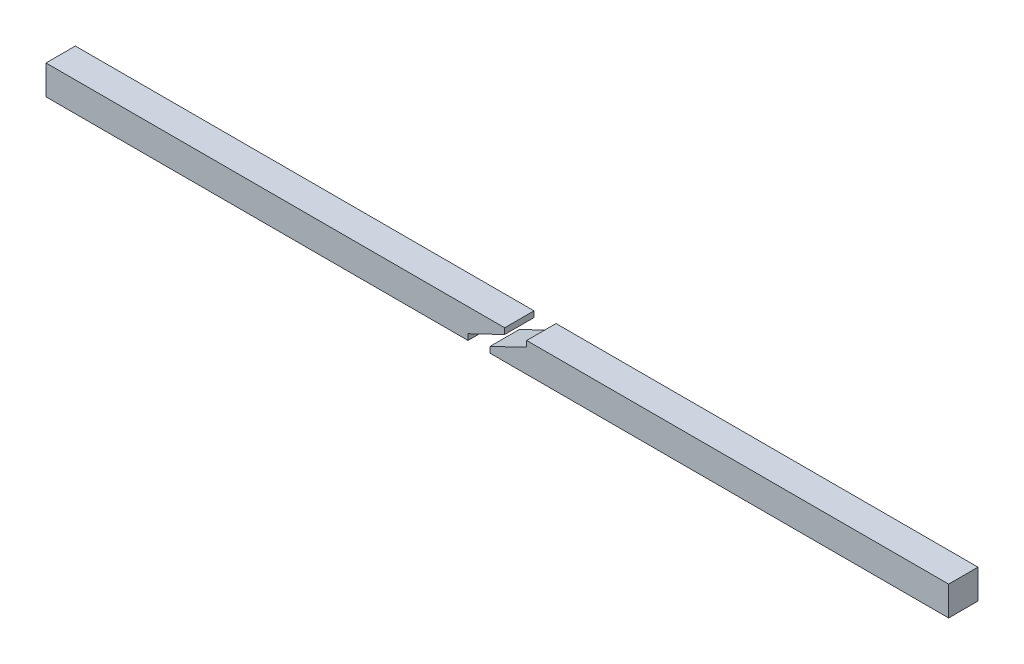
ISO-10303-21;
HEADER;
FILE_DESCRIPTION(('STEP AP214'),'2;1');
FILE_NAME('part.step','',(''),(''),'','','');
FILE_SCHEMA(('AUTOMOTIVE_DESIGN { 1 0 10303 214 1 1 1 1 }'));
ENDSEC;
DATA;
#1=APPLICATION_CONTEXT('core data for automotive mechanical design processes');
#2=APPLICATION_PROTOCOL_DEFINITION('international standard','automotive_design',2000,#1);
#3=PRODUCT_CONTEXT('',#1,'mechanical');
#4=PRODUCT('Part','Part','',(#3));
#5=PRODUCT_RELATED_PRODUCT_CATEGORY('part','',(#4));
#6=PRODUCT_DEFINITION_FORMATION('','',#4);
#7=PRODUCT_DEFINITION_CONTEXT('part definition',#1,'design');
#8=PRODUCT_DEFINITION('design','',#6,#7);
#9=PRODUCT_DEFINITION_SHAPE('','',#8);
#10=(LENGTH_UNIT() NAMED_UNIT(*) SI_UNIT(.MILLI.,.METRE.));
#11=(NAMED_UNIT(*) PLANE_ANGLE_UNIT() SI_UNIT($,.RADIAN.));
#12=(NAMED_UNIT(*) SI_UNIT($,.STERADIAN.) SOLID_ANGLE_UNIT());
#13=UNCERTAINTY_MEASURE_WITH_UNIT(LENGTH_MEASURE(1.E-05),#10,'distance_accuracy_value','');
#14=(GEOMETRIC_REPRESENTATION_CONTEXT(3) GLOBAL_UNCERTAINTY_ASSIGNED_CONTEXT((#13)) GLOBAL_UNIT_ASSIGNED_CONTEXT((#10,
#11,#12)) REPRESENTATION_CONTEXT('',''));
#15=CARTESIAN_POINT('',(0.,0.,0.));
#16=DIRECTION('',(0.,0.,1.));
#17=DIRECTION('',(1.,0.,0.));
#18=AXIS2_PLACEMENT_3D('',#15,#16,#17);
#19=CARTESIAN_POINT('',(6000.,-100.,-100.));
#20=DIRECTION('',(0.,1.,0.));
#21=DIRECTION('',(0.,0.,1.));
#22=AXIS2_PLACEMENT_3D('',#19,#20,#21);
#23=PLANE('',#22);
#24=DIRECTION('',(0.,0.,-1.));
#25=VECTOR('',#24,1.);
#26=CARTESIAN_POINT('',(2875.,-100.,-100.));
#27=LINE('',#26,#25);
#28=CARTESIAN_POINT('',(2875.,-100.,100.));
#29=VERTEX_POINT('',#28);
#30=CARTESIAN_POINT('',(2875.,-100.,-100.));
#31=VERTEX_POINT('',#30);
#32=EDGE_CURVE('E158',#29,#31,#27,.T.);
#33=ORIENTED_EDGE('',*,*,#32,.T.);
#34=DIRECTION('',(-1.,0.,0.));
#35=VECTOR('',#34,1.);
#36=CARTESIAN_POINT('',(6000.,-100.,-100.));
#37=LINE('',#36,#35);
#38=CARTESIAN_POINT('',(6000.,-100.,-100.));
#39=VERTEX_POINT('',#38);
#40=EDGE_CURVE('E13',#39,#31,#37,.T.);
#41=ORIENTED_EDGE('',*,*,#40,.F.);
#42=DIRECTION('',(0.,0.,-1.));
#43=VECTOR('',#42,1.);
#44=CARTESIAN_POINT('',(6000.,-100.,-100.));
#45=LINE('',#44,#43);
#46=CARTESIAN_POINT('',(6000.,-100.,100.));
#47=VERTEX_POINT('',#46);
#48=EDGE_CURVE('E160',#47,#39,#45,.T.);
#49=ORIENTED_EDGE('',*,*,#48,.F.);
#50=DIRECTION('',(-1.,0.,0.));
#51=VECTOR('',#50,1.);
#52=CARTESIAN_POINT('',(6000.,-100.,100.));
#53=LINE('',#52,#51);
#54=EDGE_CURVE('E166',#47,#29,#53,.T.);
#55=ORIENTED_EDGE('',*,*,#54,.T.);
#56=EDGE_LOOP('',(#33,#41,#49,#55));
#57=FACE_BOUND('',#56,.T.);
#58=ADVANCED_FACE('F75',(#57),#23,.F.);
#59=CARTESIAN_POINT('',(6000.,100.,-100.));
#60=DIRECTION('',(0.,0.,1.));
#61=DIRECTION('',(0.,-1.,0.));
#62=AXIS2_PLACEMENT_3D('',#59,#60,#61);
#63=PLANE('',#62);
#64=DIRECTION('',(0.,1.,0.));
#65=VECTOR('',#64,1.);
#66=CARTESIAN_POINT('',(2875.,100.,-100.));
#67=LINE('',#66,#65);
#68=CARTESIAN_POINT('',(2875.,-60.,-100.));
#69=VERTEX_POINT('',#68);
#70=EDGE_CURVE('E150',#31,#69,#67,.T.);
#71=ORIENTED_EDGE('',*,*,#70,.T.);
#72=DIRECTION('',(0.901523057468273,0.432731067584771,0.));
#73=VECTOR('',#72,1.);
#74=CARTESIAN_POINT('',(3125.,60.,-100.));
#75=LINE('',#74,#73);
#76=CARTESIAN_POINT('',(3125.,60.,-100.));
#77=VERTEX_POINT('',#76);
#78=EDGE_CURVE('E89',#69,#77,#75,.T.);
#79=ORIENTED_EDGE('',*,*,#78,.T.);
#80=DIRECTION('',(0.,1.,0.));
#81=VECTOR('',#80,1.);
#82=CARTESIAN_POINT('',(3125.,100.,-100.));
#83=LINE('',#82,#81);
#84=CARTESIAN_POINT('',(3125.,100.,-100.));
#85=VERTEX_POINT('',#84);
#86=EDGE_CURVE('E141',#77,#85,#83,.T.);
#87=ORIENTED_EDGE('',*,*,#86,.T.);
#88=DIRECTION('',(-1.,0.,0.));
#89=VECTOR('',#88,1.);
#90=CARTESIAN_POINT('',(6000.,100.,-100.));
#91=LINE('',#90,#89);
#92=CARTESIAN_POINT('',(6000.,100.,-100.));
#93=VERTEX_POINT('',#92);
#94=EDGE_CURVE('E82',#93,#85,#91,.T.);
#95=ORIENTED_EDGE('',*,*,#94,.F.);
#96=DIRECTION('',(0.,1.,0.));
#97=VECTOR('',#96,1.);
#98=CARTESIAN_POINT('',(6000.,100.,-100.));
#99=LINE('',#98,#97);
#100=EDGE_CURVE('E120',#39,#93,#99,.T.);
#101=ORIENTED_EDGE('',*,*,#100,.F.);
#102=ORIENTED_EDGE('',*,*,#40,.T.);
#103=EDGE_LOOP('',(#71,#79,#87,#95,#101,#102));
#104=FACE_BOUND('',#103,.T.);
#105=ADVANCED_FACE('F149',(#104),#63,.F.);
#106=CARTESIAN_POINT('',(6000.,100.,-100.));
#107=DIRECTION('',(0.,-1.,0.));
#108=DIRECTION('',(0.,0.,-1.));
#109=AXIS2_PLACEMENT_3D('',#106,#107,#108);
#110=PLANE('',#109);
#111=ORIENTED_EDGE('',*,*,#94,.T.);
#112=DIRECTION('',(0.,0.,1.));
#113=VECTOR('',#112,1.);
#114=CARTESIAN_POINT('',(3125.,100.,-100.));
#115=LINE('',#114,#113);
#116=CARTESIAN_POINT('',(3125.,100.,100.));
#117=VERTEX_POINT('',#116);
#118=EDGE_CURVE('E140',#85,#117,#115,.T.);
#119=ORIENTED_EDGE('',*,*,#118,.T.);
#120=DIRECTION('',(-1.,0.,0.));
#121=VECTOR('',#120,1.);
#122=CARTESIAN_POINT('',(6000.,100.,100.));
#123=LINE('',#122,#121);
#124=CARTESIAN_POINT('',(6000.,100.,100.));
#125=VERTEX_POINT('',#124);
#126=EDGE_CURVE('E172',#125,#117,#123,.T.);
#127=ORIENTED_EDGE('',*,*,#126,.F.);
#128=DIRECTION('',(0.,0.,1.));
#129=VECTOR('',#128,1.);
#130=CARTESIAN_POINT('',(6000.,100.,-100.));
#131=LINE('',#130,#129);
#132=EDGE_CURVE('E163',#93,#125,#131,.T.);
#133=ORIENTED_EDGE('',*,*,#132,.F.);
#134=EDGE_LOOP('',(#111,#119,#127,#133));
#135=FACE_BOUND('',#134,.T.);
#136=ADVANCED_FACE('F176',(#135),#110,.F.);
#137=CARTESIAN_POINT('',(6000.,100.,100.));
#138=DIRECTION('',(0.,0.,-1.));
#139=DIRECTION('',(0.,1.,0.));
#140=AXIS2_PLACEMENT_3D('',#137,#138,#139);
#141=PLANE('',#140);
#142=DIRECTION('',(0.,1.,0.));
#143=VECTOR('',#142,1.);
#144=CARTESIAN_POINT('',(3125.,100.,100.));
#145=LINE('',#144,#143);
#146=CARTESIAN_POINT('',(3125.,60.,100.));
#147=VERTEX_POINT('',#146);
#148=EDGE_CURVE('E151',#147,#117,#145,.T.);
#149=ORIENTED_EDGE('',*,*,#148,.F.);
#150=DIRECTION('',(0.901523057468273,0.432731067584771,0.));
#151=VECTOR('',#150,1.);
#152=CARTESIAN_POINT('',(3125.,60.,100.));
#153=LINE('',#152,#151);
#154=CARTESIAN_POINT('',(2875.,-60.,100.));
#155=VERTEX_POINT('',#154);
#156=EDGE_CURVE('E137',#155,#147,#153,.T.);
#157=ORIENTED_EDGE('',*,*,#156,.F.);
#158=DIRECTION('',(0.,-1.,0.));
#159=VECTOR('',#158,1.);
#160=CARTESIAN_POINT('',(2875.,100.,100.));
#161=LINE('',#160,#159);
#162=EDGE_CURVE('E113',#155,#29,#161,.T.);
#163=ORIENTED_EDGE('',*,*,#162,.T.);
#164=ORIENTED_EDGE('',*,*,#54,.F.);
#165=DIRECTION('',(0.,-1.,0.));
#166=VECTOR('',#165,1.);
#167=CARTESIAN_POINT('',(6000.,100.,100.));
#168=LINE('',#167,#166);
#169=EDGE_CURVE('E98',#125,#47,#168,.T.);
#170=ORIENTED_EDGE('',*,*,#169,.F.);
#171=ORIENTED_EDGE('',*,*,#126,.T.);
#172=EDGE_LOOP('',(#149,#157,#163,#164,#170,#171));
#173=FACE_BOUND('',#172,.T.);
#174=ADVANCED_FACE('F185',(#173),#141,.F.);
#175=CARTESIAN_POINT('',(6000.,0.,0.));
#176=DIRECTION('',(1.,0.,0.));
#177=DIRECTION('',(0.,0.,-1.));
#178=AXIS2_PLACEMENT_3D('',#175,#176,#177);
#179=PLANE('',#178);
#180=ORIENTED_EDGE('',*,*,#48,.T.);
#181=ORIENTED_EDGE('',*,*,#100,.T.);
#182=ORIENTED_EDGE('',*,*,#132,.T.);
#183=ORIENTED_EDGE('',*,*,#169,.T.);
#184=EDGE_LOOP('',(#180,#181,#182,#183));
#185=FACE_BOUND('',#184,.T.);
#186=ADVANCED_FACE('F178',(#185),#179,.T.);
#187=CARTESIAN_POINT('',(2875.,0.,0.));
#188=DIRECTION('',(1.,0.,0.));
#189=DIRECTION('',(0.,0.,-1.));
#190=AXIS2_PLACEMENT_3D('',#187,#188,#189);
#191=PLANE('',#190);
#192=ORIENTED_EDGE('',*,*,#162,.F.);
#193=DIRECTION('',(0.,0.,1.));
#194=VECTOR('',#193,1.);
#195=CARTESIAN_POINT('',(2875.,-60.,-100.));
#196=LINE('',#195,#194);
#197=EDGE_CURVE('E156',#69,#155,#196,.T.);
#198=ORIENTED_EDGE('',*,*,#197,.F.);
#199=ORIENTED_EDGE('',*,*,#70,.F.);
#200=ORIENTED_EDGE('',*,*,#32,.F.);
#201=EDGE_LOOP('',(#192,#198,#199,#200));
#202=FACE_BOUND('',#201,.T.);
#203=ADVANCED_FACE('F184',(#202),#191,.F.);
#204=CARTESIAN_POINT('',(3125.,60.,-100.));
#205=DIRECTION('',(0.432731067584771,-0.901523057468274,0.));
#206=DIRECTION('',(0.901523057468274,0.432731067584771,0.));
#207=AXIS2_PLACEMENT_3D('',#204,#205,#206);
#208=PLANE('',#207);
#209=ORIENTED_EDGE('',*,*,#156,.T.);
#210=DIRECTION('',(0.,0.,1.));
#211=VECTOR('',#210,1.);
#212=CARTESIAN_POINT('',(3125.,60.,-100.));
#213=LINE('',#212,#211);
#214=EDGE_CURVE('E134',#77,#147,#213,.T.);
#215=ORIENTED_EDGE('',*,*,#214,.F.);
#216=ORIENTED_EDGE('',*,*,#78,.F.);
#217=ORIENTED_EDGE('',*,*,#197,.T.);
#218=EDGE_LOOP('',(#209,#215,#216,#217));
#219=FACE_BOUND('',#218,.T.);
#220=ADVANCED_FACE('F136',(#219),#208,.F.);
#221=CARTESIAN_POINT('',(3125.,100.,-100.));
#222=DIRECTION('',(1.,0.,0.));
#223=DIRECTION('',(0.,0.,-1.));
#224=AXIS2_PLACEMENT_3D('',#221,#222,#223);
#225=PLANE('',#224);
#226=ORIENTED_EDGE('',*,*,#148,.T.);
#227=ORIENTED_EDGE('',*,*,#118,.F.);
#228=ORIENTED_EDGE('',*,*,#86,.F.);
#229=ORIENTED_EDGE('',*,*,#214,.T.);
#230=EDGE_LOOP('',(#226,#227,#228,#229));
#231=FACE_BOUND('',#230,.T.);
#232=ADVANCED_FACE('F144',(#231),#225,.F.);
#233=CLOSED_SHELL('',(#58,#105,#136,#174,#186,#203,#220,#232));
#234=MANIFOLD_SOLID_BREP('B2',#233);
#235=CARTESIAN_POINT('',(2975.,-100.,-100.));
#236=DIRECTION('',(0.,1.,0.));
#237=DIRECTION('',(0.,0.,1.));
#238=AXIS2_PLACEMENT_3D('',#235,#236,#237);
#239=PLANE('',#238);
#240=DIRECTION('',(-1.,0.,0.));
#241=VECTOR('',#240,1.);
#242=CARTESIAN_POINT('',(2975.,-100.,-100.));
#243=LINE('',#242,#241);
#244=CARTESIAN_POINT('',(2725.,-100.,-100.));
#245=VERTEX_POINT('',#244);
#246=CARTESIAN_POINT('',(-150.,-100.,-100.));
#247=VERTEX_POINT('',#246);
#248=EDGE_CURVE('E73',#245,#247,#243,.T.);
#249=ORIENTED_EDGE('',*,*,#248,.F.);
#250=DIRECTION('',(0.,0.,1.));
#251=VECTOR('',#250,1.);
#252=CARTESIAN_POINT('',(2725.,-100.,-100.));
#253=LINE('',#252,#251);
#254=CARTESIAN_POINT('',(2725.,-100.,100.));
#255=VERTEX_POINT('',#254);
#256=EDGE_CURVE('E328',#245,#255,#253,.T.);
#257=ORIENTED_EDGE('',*,*,#256,.T.);
#258=DIRECTION('',(-1.,0.,0.));
#259=VECTOR('',#258,1.);
#260=CARTESIAN_POINT('',(2975.,-100.,100.));
#261=LINE('',#260,#259);
#262=CARTESIAN_POINT('',(-150.,-100.,100.));
#263=VERTEX_POINT('',#262);
#264=EDGE_CURVE('E321',#255,#263,#261,.T.);
#265=ORIENTED_EDGE('',*,*,#264,.T.);
#266=DIRECTION('',(0.,0.,-1.));
#267=VECTOR('',#266,1.);
#268=CARTESIAN_POINT('',(-150.,-100.,-100.));
#269=LINE('',#268,#267);
#270=EDGE_CURVE('E325',#263,#247,#269,.T.);
#271=ORIENTED_EDGE('',*,*,#270,.T.);
#272=EDGE_LOOP('',(#249,#257,#265,#271));
#273=FACE_BOUND('',#272,.T.);
#274=ADVANCED_FACE('F279',(#273),#239,.F.);
#275=CARTESIAN_POINT('',(2975.,100.,-100.));
#276=DIRECTION('',(0.,0.,1.));
#277=DIRECTION('',(0.,-1.,0.));
#278=AXIS2_PLACEMENT_3D('',#275,#276,#277);
#279=PLANE('',#278);
#280=DIRECTION('',(-0.901523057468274,-0.432731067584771,0.));
#281=VECTOR('',#280,1.);
#282=CARTESIAN_POINT('',(2975.,60.,-100.));
#283=LINE('',#282,#281);
#284=CARTESIAN_POINT('',(2975.,60.,-100.));
#285=VERTEX_POINT('',#284);
#286=CARTESIAN_POINT('',(2725.,-60.,-100.));
#287=VERTEX_POINT('',#286);
#288=EDGE_CURVE('E293',#285,#287,#283,.T.);
#289=ORIENTED_EDGE('',*,*,#288,.T.);
#290=DIRECTION('',(0.,-1.,0.));
#291=VECTOR('',#290,1.);
#292=CARTESIAN_POINT('',(2725.,-60.,-100.));
#293=LINE('',#292,#291);
#294=EDGE_CURVE('E367',#287,#245,#293,.T.);
#295=ORIENTED_EDGE('',*,*,#294,.T.);
#296=ORIENTED_EDGE('',*,*,#248,.T.);
#297=DIRECTION('',(0.,1.,0.));
#298=VECTOR('',#297,1.);
#299=CARTESIAN_POINT('',(-150.,100.,-100.));
#300=LINE('',#299,#298);
#301=CARTESIAN_POINT('',(-150.,100.,-100.));
#302=VERTEX_POINT('',#301);
#303=EDGE_CURVE('E346',#247,#302,#300,.T.);
#304=ORIENTED_EDGE('',*,*,#303,.T.);
#305=DIRECTION('',(-1.,0.,0.));
#306=VECTOR('',#305,1.);
#307=CARTESIAN_POINT('',(2975.,100.,-100.));
#308=LINE('',#307,#306);
#309=CARTESIAN_POINT('',(2975.,100.,-100.));
#310=VERTEX_POINT('',#309);
#311=EDGE_CURVE('E286',#310,#302,#308,.T.);
#312=ORIENTED_EDGE('',*,*,#311,.F.);
#313=DIRECTION('',(0.,1.,0.));
#314=VECTOR('',#313,1.);
#315=CARTESIAN_POINT('',(2975.,100.,-100.));
#316=LINE('',#315,#314);
#317=EDGE_CURVE('E341',#285,#310,#316,.T.);
#318=ORIENTED_EDGE('',*,*,#317,.F.);
#319=EDGE_LOOP('',(#289,#295,#296,#304,#312,#318));
#320=FACE_BOUND('',#319,.T.);
#321=ADVANCED_FACE('F363',(#320),#279,.F.);
#322=CARTESIAN_POINT('',(2975.,100.,-100.));
#323=DIRECTION('',(0.,-1.,0.));
#324=DIRECTION('',(0.,0.,-1.));
#325=AXIS2_PLACEMENT_3D('',#322,#323,#324);
#326=PLANE('',#325);
#327=DIRECTION('',(0.,0.,1.));
#328=VECTOR('',#327,1.);
#329=CARTESIAN_POINT('',(-150.,100.,-100.));
#330=LINE('',#329,#328);
#331=CARTESIAN_POINT('',(-150.,100.,100.));
#332=VERTEX_POINT('',#331);
#333=EDGE_CURVE('E342',#302,#332,#330,.T.);
#334=ORIENTED_EDGE('',*,*,#333,.T.);
#335=DIRECTION('',(-1.,0.,0.));
#336=VECTOR('',#335,1.);
#337=CARTESIAN_POINT('',(2975.,100.,100.));
#338=LINE('',#337,#336);
#339=CARTESIAN_POINT('',(2975.,100.,100.));
#340=VERTEX_POINT('',#339);
#341=EDGE_CURVE('E331',#340,#332,#338,.T.);
#342=ORIENTED_EDGE('',*,*,#341,.F.);
#343=DIRECTION('',(0.,0.,1.));
#344=VECTOR('',#343,1.);
#345=CARTESIAN_POINT('',(2975.,100.,-100.));
#346=LINE('',#345,#344);
#347=EDGE_CURVE('E302',#310,#340,#346,.T.);
#348=ORIENTED_EDGE('',*,*,#347,.F.);
#349=ORIENTED_EDGE('',*,*,#311,.T.);
#350=EDGE_LOOP('',(#334,#342,#348,#349));
#351=FACE_BOUND('',#350,.T.);
#352=ADVANCED_FACE('F360',(#351),#326,.F.);
#353=CARTESIAN_POINT('',(2975.,100.,100.));
#354=DIRECTION('',(0.,0.,-1.));
#355=DIRECTION('',(0.,1.,0.));
#356=AXIS2_PLACEMENT_3D('',#353,#354,#355);
#357=PLANE('',#356);
#358=ORIENTED_EDGE('',*,*,#264,.F.);
#359=DIRECTION('',(0.,-1.,0.));
#360=VECTOR('',#359,1.);
#361=CARTESIAN_POINT('',(2725.,-60.,100.));
#362=LINE('',#361,#360);
#363=CARTESIAN_POINT('',(2725.,-60.,100.));
#364=VERTEX_POINT('',#363);
#365=EDGE_CURVE('E381',#364,#255,#362,.T.);
#366=ORIENTED_EDGE('',*,*,#365,.F.);
#367=DIRECTION('',(-0.901523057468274,-0.432731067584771,0.));
#368=VECTOR('',#367,1.);
#369=CARTESIAN_POINT('',(2975.,60.,100.));
#370=LINE('',#369,#368);
#371=CARTESIAN_POINT('',(2975.,60.,100.));
#372=VERTEX_POINT('',#371);
#373=EDGE_CURVE('E379',#372,#364,#370,.T.);
#374=ORIENTED_EDGE('',*,*,#373,.F.);
#375=DIRECTION('',(0.,-1.,0.));
#376=VECTOR('',#375,1.);
#377=CARTESIAN_POINT('',(2975.,100.,100.));
#378=LINE('',#377,#376);
#379=EDGE_CURVE('E332',#340,#372,#378,.T.);
#380=ORIENTED_EDGE('',*,*,#379,.F.);
#381=ORIENTED_EDGE('',*,*,#341,.T.);
#382=DIRECTION('',(0.,-1.,0.));
#383=VECTOR('',#382,1.);
#384=CARTESIAN_POINT('',(-150.,100.,100.));
#385=LINE('',#384,#383);
#386=EDGE_CURVE('E336',#332,#263,#385,.T.);
#387=ORIENTED_EDGE('',*,*,#386,.T.);
#388=EDGE_LOOP('',(#358,#366,#374,#380,#381,#387));
#389=FACE_BOUND('',#388,.T.);
#390=ADVANCED_FACE('F337',(#389),#357,.F.);
#391=CARTESIAN_POINT('',(2975.,0.,0.));
#392=DIRECTION('',(1.,0.,0.));
#393=DIRECTION('',(0.,0.,-1.));
#394=AXIS2_PLACEMENT_3D('',#391,#392,#393);
#395=PLANE('',#394);
#396=DIRECTION('',(0.,0.,1.));
#397=VECTOR('',#396,1.);
#398=CARTESIAN_POINT('',(2975.,60.,-100.));
#399=LINE('',#398,#397);
#400=EDGE_CURVE('E351',#285,#372,#399,.T.);
#401=ORIENTED_EDGE('',*,*,#400,.F.);
#402=ORIENTED_EDGE('',*,*,#317,.T.);
#403=ORIENTED_EDGE('',*,*,#347,.T.);
#404=ORIENTED_EDGE('',*,*,#379,.T.);
#405=EDGE_LOOP('',(#401,#402,#403,#404));
#406=FACE_BOUND('',#405,.T.);
#407=ADVANCED_FACE('F383',(#406),#395,.T.);
#408=CARTESIAN_POINT('',(-150.,0.,0.));
#409=DIRECTION('',(1.,0.,0.));
#410=DIRECTION('',(0.,0.,-1.));
#411=AXIS2_PLACEMENT_3D('',#408,#409,#410);
#412=PLANE('',#411);
#413=ORIENTED_EDGE('',*,*,#270,.F.);
#414=ORIENTED_EDGE('',*,*,#386,.F.);
#415=ORIENTED_EDGE('',*,*,#333,.F.);
#416=ORIENTED_EDGE('',*,*,#303,.F.);
#417=EDGE_LOOP('',(#413,#414,#415,#416));
#418=FACE_BOUND('',#417,.T.);
#419=ADVANCED_FACE('F345',(#418),#412,.F.);
#420=CARTESIAN_POINT('',(2725.,-60.,-100.));
#421=DIRECTION('',(-1.,0.,0.));
#422=DIRECTION('',(0.,0.,1.));
#423=AXIS2_PLACEMENT_3D('',#420,#421,#422);
#424=PLANE('',#423);
#425=ORIENTED_EDGE('',*,*,#365,.T.);
#426=ORIENTED_EDGE('',*,*,#256,.F.);
#427=ORIENTED_EDGE('',*,*,#294,.F.);
#428=DIRECTION('',(0.,0.,1.));
#429=VECTOR('',#428,1.);
#430=CARTESIAN_POINT('',(2725.,-60.,-100.));
#431=LINE('',#430,#429);
#432=EDGE_CURVE('E347',#287,#364,#431,.T.);
#433=ORIENTED_EDGE('',*,*,#432,.T.);
#434=EDGE_LOOP('',(#425,#426,#427,#433));
#435=FACE_BOUND('',#434,.T.);
#436=ADVANCED_FACE('F389',(#435),#424,.F.);
#437=CARTESIAN_POINT('',(2975.,60.,-100.));
#438=DIRECTION('',(-0.432731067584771,0.901523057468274,0.));
#439=DIRECTION('',(-0.901523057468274,-0.432731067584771,0.));
#440=AXIS2_PLACEMENT_3D('',#437,#438,#439);
#441=PLANE('',#440);
#442=ORIENTED_EDGE('',*,*,#373,.T.);
#443=ORIENTED_EDGE('',*,*,#432,.F.);
#444=ORIENTED_EDGE('',*,*,#288,.F.);
#445=ORIENTED_EDGE('',*,*,#400,.T.);
#446=EDGE_LOOP('',(#442,#443,#444,#445));
#447=FACE_BOUND('',#446,.T.);
#448=ADVANCED_FACE('F378',(#447),#441,.F.);
#449=CLOSED_SHELL('',(#274,#321,#352,#390,#407,#419,#436,#448));
#450=MANIFOLD_SOLID_BREP('B7',#449);
#451=ADVANCED_BREP_SHAPE_REPRESENTATION('',(#18,#234,#450),#14);
#452=SHAPE_DEFINITION_REPRESENTATION(#9,#451);
ENDSEC;
END-ISO-10303-21;
